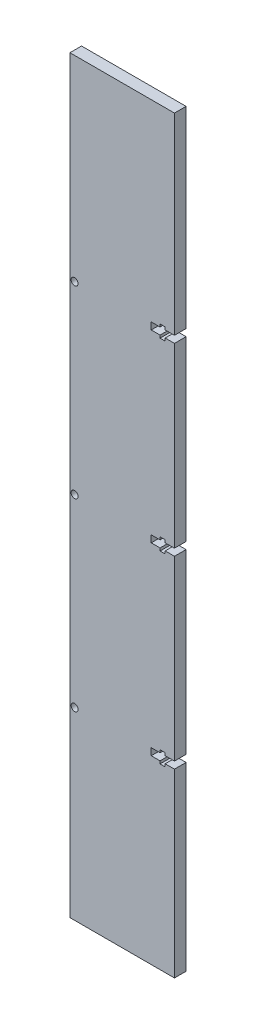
ISO-10303-21;
HEADER;
FILE_DESCRIPTION(('STEP AP214'),'2;1');
FILE_NAME('part.step','',(''),(''),'','','');
FILE_SCHEMA(('AUTOMOTIVE_DESIGN { 1 0 10303 214 1 1 1 1 }'));
ENDSEC;
DATA;
#1=APPLICATION_CONTEXT('core data for automotive mechanical design processes');
#2=APPLICATION_PROTOCOL_DEFINITION('international standard','automotive_design',2000,#1);
#3=PRODUCT_CONTEXT('',#1,'mechanical');
#4=PRODUCT('Part','Part','',(#3));
#5=PRODUCT_RELATED_PRODUCT_CATEGORY('part','',(#4));
#6=PRODUCT_DEFINITION_FORMATION('','',#4);
#7=PRODUCT_DEFINITION_CONTEXT('part definition',#1,'design');
#8=PRODUCT_DEFINITION('design','',#6,#7);
#9=PRODUCT_DEFINITION_SHAPE('','',#8);
#10=(LENGTH_UNIT() NAMED_UNIT(*) SI_UNIT(.MILLI.,.METRE.));
#11=(NAMED_UNIT(*) PLANE_ANGLE_UNIT() SI_UNIT($,.RADIAN.));
#12=(NAMED_UNIT(*) SI_UNIT($,.STERADIAN.) SOLID_ANGLE_UNIT());
#13=UNCERTAINTY_MEASURE_WITH_UNIT(LENGTH_MEASURE(1.E-05),#10,'distance_accuracy_value','');
#14=(GEOMETRIC_REPRESENTATION_CONTEXT(3) GLOBAL_UNCERTAINTY_ASSIGNED_CONTEXT((#13)) GLOBAL_UNIT_ASSIGNED_CONTEXT((#10,
#11,#12)) REPRESENTATION_CONTEXT('',''));
#15=CARTESIAN_POINT('',(0.,0.,0.));
#16=DIRECTION('',(0.,0.,1.));
#17=DIRECTION('',(1.,0.,0.));
#18=AXIS2_PLACEMENT_3D('',#15,#16,#17);
#19=CARTESIAN_POINT('',(18.4999999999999,6.13941264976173E-13,10.));
#20=DIRECTION('',(1.,0.,0.));
#21=DIRECTION('',(0.,1.,0.));
#22=AXIS2_PLACEMENT_3D('',#19,#20,#21);
#23=PLANE('',#22);
#24=DIRECTION('',(0.,0.,1.));
#25=VECTOR('',#24,1.);
#26=CARTESIAN_POINT('',(18.5,-3.99999999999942,10.));
#27=LINE('',#26,#25);
#28=CARTESIAN_POINT('',(18.5,-3.99999999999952,5.));
#29=VERTEX_POINT('',#28);
#30=CARTESIAN_POINT('',(18.5,-3.99999999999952,0.));
#31=VERTEX_POINT('',#30);
#32=EDGE_CURVE('E283',#29,#31,#27,.F.);
#33=ORIENTED_EDGE('',*,*,#32,.T.);
#34=DIRECTION('',(0.,1.,0.));
#35=VECTOR('',#34,1.);
#36=CARTESIAN_POINT('',(18.5,0.,0.));
#37=LINE('',#36,#35);
#38=CARTESIAN_POINT('',(18.5,-5.14999999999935,0.));
#39=VERTEX_POINT('',#38);
#40=EDGE_CURVE('E286',#31,#39,#37,.F.);
#41=ORIENTED_EDGE('',*,*,#40,.T.);
#42=DIRECTION('',(0.,0.,1.));
#43=VECTOR('',#42,1.);
#44=CARTESIAN_POINT('',(18.5000000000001,-5.14999999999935,10.));
#45=LINE('',#44,#43);
#46=CARTESIAN_POINT('',(18.5,-5.14999999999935,5.));
#47=VERTEX_POINT('',#46);
#48=EDGE_CURVE('E525',#39,#47,#45,.T.);
#49=ORIENTED_EDGE('',*,*,#48,.T.);
#50=DIRECTION('',(0.,1.,0.));
#51=VECTOR('',#50,1.);
#52=CARTESIAN_POINT('',(18.4999999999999,6.13941264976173E-13,5.));
#53=LINE('',#52,#51);
#54=EDGE_CURVE('E288',#29,#47,#53,.F.);
#55=ORIENTED_EDGE('',*,*,#54,.F.);
#56=EDGE_LOOP('',(#33,#41,#49,#55));
#57=FACE_BOUND('',#56,.T.);
#58=ADVANCED_FACE('F25',(#57),#23,.F.);
#59=CARTESIAN_POINT('',(16.2999999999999,5.40932033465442E-13,10.));
#60=DIRECTION('',(-1.,0.,0.));
#61=DIRECTION('',(0.,-1.,0.));
#62=AXIS2_PLACEMENT_3D('',#59,#60,#61);
#63=PLANE('',#62);
#64=DIRECTION('',(0.,0.,1.));
#65=VECTOR('',#64,1.);
#66=CARTESIAN_POINT('',(16.3000000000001,-5.14999999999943,10.));
#67=LINE('',#66,#65);
#68=CARTESIAN_POINT('',(16.3000000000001,-5.14999999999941,5.));
#69=VERTEX_POINT('',#68);
#70=CARTESIAN_POINT('',(16.3000000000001,-5.14999999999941,0.));
#71=VERTEX_POINT('',#70);
#72=EDGE_CURVE('E278',#69,#71,#67,.F.);
#73=ORIENTED_EDGE('',*,*,#72,.T.);
#74=DIRECTION('',(0.,1.,0.));
#75=VECTOR('',#74,1.);
#76=CARTESIAN_POINT('',(16.3000000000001,0.,0.));
#77=LINE('',#76,#75);
#78=CARTESIAN_POINT('',(16.3,-3.99999999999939,0.));
#79=VERTEX_POINT('',#78);
#80=EDGE_CURVE('E331',#71,#79,#77,.T.);
#81=ORIENTED_EDGE('',*,*,#80,.T.);
#82=DIRECTION('',(0.,0.,1.));
#83=VECTOR('',#82,1.);
#84=CARTESIAN_POINT('',(16.3,-3.99999999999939,10.));
#85=LINE('',#84,#83);
#86=CARTESIAN_POINT('',(16.3,-3.99999999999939,5.));
#87=VERTEX_POINT('',#86);
#88=EDGE_CURVE('E519',#79,#87,#85,.T.);
#89=ORIENTED_EDGE('',*,*,#88,.T.);
#90=DIRECTION('',(0.,-1.,0.));
#91=VECTOR('',#90,1.);
#92=CARTESIAN_POINT('',(16.2999999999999,5.40932033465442E-13,5.));
#93=LINE('',#92,#91);
#94=EDGE_CURVE('E353',#69,#87,#93,.F.);
#95=ORIENTED_EDGE('',*,*,#94,.F.);
#96=EDGE_LOOP('',(#73,#81,#89,#95));
#97=FACE_BOUND('',#96,.T.);
#98=ADVANCED_FACE('F1006',(#97),#63,.F.);
#99=CARTESIAN_POINT('',(16.2999999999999,4.42580754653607E-13,10.));
#100=DIRECTION('',(-1.,0.,0.));
#101=DIRECTION('',(0.,-1.,0.));
#102=AXIS2_PLACEMENT_3D('',#99,#100,#101);
#103=PLANE('',#102);
#104=DIRECTION('',(0.,0.,1.));
#105=VECTOR('',#104,1.);
#106=CARTESIAN_POINT('',(16.2999999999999,-0.999999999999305,10.));
#107=LINE('',#106,#105);
#108=CARTESIAN_POINT('',(16.2999999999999,-0.999999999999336,5.));
#109=VERTEX_POINT('',#108);
#110=CARTESIAN_POINT('',(16.2999999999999,-0.999999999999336,0.));
#111=VERTEX_POINT('',#110);
#112=EDGE_CURVE('E513',#109,#111,#107,.F.);
#113=ORIENTED_EDGE('',*,*,#112,.T.);
#114=DIRECTION('',(0.,1.,0.));
#115=VECTOR('',#114,1.);
#116=CARTESIAN_POINT('',(16.2999999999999,0.,0.));
#117=LINE('',#116,#115);
#118=CARTESIAN_POINT('',(16.2999999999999,0.150000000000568,0.));
#119=VERTEX_POINT('',#118);
#120=EDGE_CURVE('E329',#111,#119,#117,.T.);
#121=ORIENTED_EDGE('',*,*,#120,.T.);
#122=DIRECTION('',(0.,0.,1.));
#123=VECTOR('',#122,1.);
#124=CARTESIAN_POINT('',(16.2999999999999,0.150000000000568,10.));
#125=LINE('',#124,#123);
#126=CARTESIAN_POINT('',(16.2999999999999,0.150000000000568,5.));
#127=VERTEX_POINT('',#126);
#128=EDGE_CURVE('E501',#119,#127,#125,.T.);
#129=ORIENTED_EDGE('',*,*,#128,.T.);
#130=DIRECTION('',(0.,-1.,0.));
#131=VECTOR('',#130,1.);
#132=CARTESIAN_POINT('',(16.2999999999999,4.42580754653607E-13,5.));
#133=LINE('',#132,#131);
#134=EDGE_CURVE('E351',#109,#127,#133,.F.);
#135=ORIENTED_EDGE('',*,*,#134,.F.);
#136=EDGE_LOOP('',(#113,#121,#129,#135));
#137=FACE_BOUND('',#136,.T.);
#138=ADVANCED_FACE('F997',(#137),#103,.F.);
#139=CARTESIAN_POINT('',(18.4999999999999,6.13941264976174E-13,10.));
#140=DIRECTION('',(1.,0.,0.));
#141=DIRECTION('',(0.,1.,0.));
#142=AXIS2_PLACEMENT_3D('',#139,#140,#141);
#143=PLANE('',#142);
#144=DIRECTION('',(0.,0.,1.));
#145=VECTOR('',#144,1.);
#146=CARTESIAN_POINT('',(18.4999999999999,0.15000000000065,10.));
#147=LINE('',#146,#145);
#148=CARTESIAN_POINT('',(18.4999999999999,0.15000000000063,5.));
#149=VERTEX_POINT('',#148);
#150=CARTESIAN_POINT('',(18.4999999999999,0.15000000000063,0.));
#151=VERTEX_POINT('',#150);
#152=EDGE_CURVE('E507',#149,#151,#147,.F.);
#153=ORIENTED_EDGE('',*,*,#152,.T.);
#154=DIRECTION('',(0.,1.,0.));
#155=VECTOR('',#154,1.);
#156=CARTESIAN_POINT('',(18.4999999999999,0.,0.));
#157=LINE('',#156,#155);
#158=CARTESIAN_POINT('',(18.4999999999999,-0.999999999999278,0.));
#159=VERTEX_POINT('',#158);
#160=EDGE_CURVE('E327',#151,#159,#157,.F.);
#161=ORIENTED_EDGE('',*,*,#160,.T.);
#162=DIRECTION('',(0.,0.,1.));
#163=VECTOR('',#162,1.);
#164=CARTESIAN_POINT('',(18.4999999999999,-0.999999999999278,10.));
#165=LINE('',#164,#163);
#166=CARTESIAN_POINT('',(18.4999999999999,-0.999999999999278,5.));
#167=VERTEX_POINT('',#166);
#168=EDGE_CURVE('E495',#159,#167,#165,.T.);
#169=ORIENTED_EDGE('',*,*,#168,.T.);
#170=DIRECTION('',(0.,1.,0.));
#171=VECTOR('',#170,1.);
#172=CARTESIAN_POINT('',(18.4999999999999,6.13941264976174E-13,5.));
#173=LINE('',#172,#171);
#174=EDGE_CURVE('E349',#149,#167,#173,.F.);
#175=ORIENTED_EDGE('',*,*,#174,.F.);
#176=EDGE_LOOP('',(#153,#161,#169,#175));
#177=FACE_BOUND('',#176,.T.);
#178=ADVANCED_FACE('F988',(#177),#143,.F.);
#179=CARTESIAN_POINT('',(18.4999999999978,-5.02315580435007E-13,10.));
#180=DIRECTION('',(1.,0.,0.));
#181=DIRECTION('',(0.,1.,0.));
#182=AXIS2_PLACEMENT_3D('',#179,#180,#181);
#183=PLANE('',#182);
#184=DIRECTION('',(0.,0.,1.));
#185=VECTOR('',#184,1.);
#186=CARTESIAN_POINT('',(18.4999999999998,75.3750000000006,10.));
#187=LINE('',#186,#185);
#188=CARTESIAN_POINT('',(18.4999999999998,75.3750000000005,5.));
#189=VERTEX_POINT('',#188);
#190=CARTESIAN_POINT('',(18.4999999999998,75.3750000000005,0.));
#191=VERTEX_POINT('',#190);
#192=EDGE_CURVE('E489',#189,#191,#187,.F.);
#193=ORIENTED_EDGE('',*,*,#192,.T.);
#194=DIRECTION('',(0.,1.,0.));
#195=VECTOR('',#194,1.);
#196=CARTESIAN_POINT('',(18.4999999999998,0.,0.));
#197=LINE('',#196,#195);
#198=CARTESIAN_POINT('',(18.4999999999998,74.2250000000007,0.));
#199=VERTEX_POINT('',#198);
#200=EDGE_CURVE('E325',#191,#199,#197,.F.);
#201=ORIENTED_EDGE('',*,*,#200,.T.);
#202=DIRECTION('',(0.,0.,1.));
#203=VECTOR('',#202,1.);
#204=CARTESIAN_POINT('',(18.4999999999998,74.2250000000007,10.));
#205=LINE('',#204,#203);
#206=CARTESIAN_POINT('',(18.4999999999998,74.2250000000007,5.));
#207=VERTEX_POINT('',#206);
#208=EDGE_CURVE('E477',#199,#207,#205,.T.);
#209=ORIENTED_EDGE('',*,*,#208,.T.);
#210=DIRECTION('',(0.,1.,0.));
#211=VECTOR('',#210,1.);
#212=CARTESIAN_POINT('',(18.4999999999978,-5.02315580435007E-13,5.));
#213=LINE('',#212,#211);
#214=EDGE_CURVE('E347',#189,#207,#213,.F.);
#215=ORIENTED_EDGE('',*,*,#214,.F.);
#216=EDGE_LOOP('',(#193,#201,#209,#215));
#217=FACE_BOUND('',#216,.T.);
#218=ADVANCED_FACE('F979',(#217),#183,.F.);
#219=CARTESIAN_POINT('',(16.299999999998,-3.93405115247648E-13,10.));
#220=DIRECTION('',(-1.,0.,0.));
#221=DIRECTION('',(0.,-1.,0.));
#222=AXIS2_PLACEMENT_3D('',#219,#220,#221);
#223=PLANE('',#222);
#224=DIRECTION('',(0.,0.,1.));
#225=VECTOR('',#224,1.);
#226=CARTESIAN_POINT('',(16.2999999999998,74.2250000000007,10.));
#227=LINE('',#226,#225);
#228=CARTESIAN_POINT('',(16.2999999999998,74.2250000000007,5.));
#229=VERTEX_POINT('',#228);
#230=CARTESIAN_POINT('',(16.2999999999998,74.2250000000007,0.));
#231=VERTEX_POINT('',#230);
#232=EDGE_CURVE('E483',#229,#231,#227,.F.);
#233=ORIENTED_EDGE('',*,*,#232,.T.);
#234=DIRECTION('',(0.,1.,0.));
#235=VECTOR('',#234,1.);
#236=CARTESIAN_POINT('',(16.2999999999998,0.,0.));
#237=LINE('',#236,#235);
#238=CARTESIAN_POINT('',(16.2999999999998,75.3750000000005,0.));
#239=VERTEX_POINT('',#238);
#240=EDGE_CURVE('E323',#231,#239,#237,.T.);
#241=ORIENTED_EDGE('',*,*,#240,.T.);
#242=DIRECTION('',(0.,0.,1.));
#243=VECTOR('',#242,1.);
#244=CARTESIAN_POINT('',(16.2999999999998,75.3750000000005,10.));
#245=LINE('',#244,#243);
#246=CARTESIAN_POINT('',(16.2999999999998,75.3750000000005,5.));
#247=VERTEX_POINT('',#246);
#248=EDGE_CURVE('E471',#239,#247,#245,.T.);
#249=ORIENTED_EDGE('',*,*,#248,.T.);
#250=DIRECTION('',(0.,-1.,0.));
#251=VECTOR('',#250,1.);
#252=CARTESIAN_POINT('',(16.299999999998,-3.93405115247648E-13,5.));
#253=LINE('',#252,#251);
#254=EDGE_CURVE('E345',#229,#247,#253,.F.);
#255=ORIENTED_EDGE('',*,*,#254,.F.);
#256=EDGE_LOOP('',(#233,#241,#249,#255));
#257=FACE_BOUND('',#256,.T.);
#258=ADVANCED_FACE('F970',(#257),#223,.F.);
#259=CARTESIAN_POINT('',(16.299999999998,-3.9340511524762E-13,10.));
#260=DIRECTION('',(-1.,0.,0.));
#261=DIRECTION('',(0.,-1.,0.));
#262=AXIS2_PLACEMENT_3D('',#259,#260,#261);
#263=PLANE('',#262);
#264=DIRECTION('',(0.,0.,1.));
#265=VECTOR('',#264,1.);
#266=CARTESIAN_POINT('',(16.2999999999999,78.3750000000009,10.));
#267=LINE('',#266,#265);
#268=CARTESIAN_POINT('',(16.2999999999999,78.3750000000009,5.));
#269=VERTEX_POINT('',#268);
#270=CARTESIAN_POINT('',(16.2999999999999,78.3750000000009,0.));
#271=VERTEX_POINT('',#270);
#272=EDGE_CURVE('E465',#269,#271,#267,.F.);
#273=ORIENTED_EDGE('',*,*,#272,.T.);
#274=DIRECTION('',(0.,1.,0.));
#275=VECTOR('',#274,1.);
#276=CARTESIAN_POINT('',(16.2999999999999,0.,0.));
#277=LINE('',#276,#275);
#278=CARTESIAN_POINT('',(16.2999999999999,79.5250000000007,0.));
#279=VERTEX_POINT('',#278);
#280=EDGE_CURVE('E321',#271,#279,#277,.T.);
#281=ORIENTED_EDGE('',*,*,#280,.T.);
#282=DIRECTION('',(0.,0.,1.));
#283=VECTOR('',#282,1.);
#284=CARTESIAN_POINT('',(16.2999999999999,79.5250000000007,10.));
#285=LINE('',#284,#283);
#286=CARTESIAN_POINT('',(16.2999999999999,79.5250000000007,5.));
#287=VERTEX_POINT('',#286);
#288=EDGE_CURVE('E453',#279,#287,#285,.T.);
#289=ORIENTED_EDGE('',*,*,#288,.T.);
#290=DIRECTION('',(0.,-1.,0.));
#291=VECTOR('',#290,1.);
#292=CARTESIAN_POINT('',(16.299999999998,-3.9340511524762E-13,5.));
#293=LINE('',#292,#291);
#294=EDGE_CURVE('E343',#269,#287,#293,.F.);
#295=ORIENTED_EDGE('',*,*,#294,.F.);
#296=EDGE_LOOP('',(#273,#281,#289,#295));
#297=FACE_BOUND('',#296,.T.);
#298=ADVANCED_FACE('F961',(#297),#263,.F.);
#299=CARTESIAN_POINT('',(18.4999999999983,-3.9068989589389E-13,10.));
#300=DIRECTION('',(1.,0.,0.));
#301=DIRECTION('',(0.,1.,0.));
#302=AXIS2_PLACEMENT_3D('',#299,#300,#301);
#303=PLANE('',#302);
#304=DIRECTION('',(0.,0.,1.));
#305=VECTOR('',#304,1.);
#306=CARTESIAN_POINT('',(18.4999999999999,79.5250000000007,10.));
#307=LINE('',#306,#305);
#308=CARTESIAN_POINT('',(18.4999999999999,79.5250000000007,5.));
#309=VERTEX_POINT('',#308);
#310=CARTESIAN_POINT('',(18.4999999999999,79.5250000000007,0.));
#311=VERTEX_POINT('',#310);
#312=EDGE_CURVE('E459',#309,#311,#307,.F.);
#313=ORIENTED_EDGE('',*,*,#312,.T.);
#314=DIRECTION('',(0.,1.,0.));
#315=VECTOR('',#314,1.);
#316=CARTESIAN_POINT('',(18.4999999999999,0.,0.));
#317=LINE('',#316,#315);
#318=CARTESIAN_POINT('',(18.4999999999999,78.3750000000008,0.));
#319=VERTEX_POINT('',#318);
#320=EDGE_CURVE('E319',#311,#319,#317,.F.);
#321=ORIENTED_EDGE('',*,*,#320,.T.);
#322=DIRECTION('',(0.,0.,1.));
#323=VECTOR('',#322,1.);
#324=CARTESIAN_POINT('',(18.4999999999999,78.3750000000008,10.));
#325=LINE('',#324,#323);
#326=CARTESIAN_POINT('',(18.4999999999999,78.3750000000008,5.));
#327=VERTEX_POINT('',#326);
#328=EDGE_CURVE('E447',#319,#327,#325,.T.);
#329=ORIENTED_EDGE('',*,*,#328,.T.);
#330=DIRECTION('',(0.,1.,0.));
#331=VECTOR('',#330,1.);
#332=CARTESIAN_POINT('',(18.4999999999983,-3.9068989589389E-13,5.));
#333=LINE('',#332,#331);
#334=EDGE_CURVE('E341',#309,#327,#333,.F.);
#335=ORIENTED_EDGE('',*,*,#334,.F.);
#336=EDGE_LOOP('',(#313,#321,#329,#335));
#337=FACE_BOUND('',#336,.T.);
#338=ADVANCED_FACE('F952',(#337),#303,.F.);
#339=CARTESIAN_POINT('',(18.4999999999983,4.46502738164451E-13,10.));
#340=DIRECTION('',(1.,0.,0.));
#341=DIRECTION('',(0.,1.,0.));
#342=AXIS2_PLACEMENT_3D('',#339,#340,#341);
#343=PLANE('',#342);
#344=DIRECTION('',(0.,0.,1.));
#345=VECTOR('',#344,1.);
#346=CARTESIAN_POINT('',(18.5000000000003,-83.3749999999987,10.));
#347=LINE('',#346,#345);
#348=CARTESIAN_POINT('',(18.5000000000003,-83.3749999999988,5.));
#349=VERTEX_POINT('',#348);
#350=CARTESIAN_POINT('',(18.5000000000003,-83.3749999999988,0.));
#351=VERTEX_POINT('',#350);
#352=EDGE_CURVE('E421',#349,#351,#347,.F.);
#353=ORIENTED_EDGE('',*,*,#352,.T.);
#354=DIRECTION('',(0.,1.,0.));
#355=VECTOR('',#354,1.);
#356=CARTESIAN_POINT('',(18.5000000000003,0.,0.));
#357=LINE('',#356,#355);
#358=CARTESIAN_POINT('',(18.5000000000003,-84.5249999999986,0.));
#359=VERTEX_POINT('',#358);
#360=EDGE_CURVE('E317',#351,#359,#357,.F.);
#361=ORIENTED_EDGE('',*,*,#360,.T.);
#362=DIRECTION('',(0.,0.,1.));
#363=VECTOR('',#362,1.);
#364=CARTESIAN_POINT('',(18.5000000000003,-84.5249999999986,10.));
#365=LINE('',#364,#363);
#366=CARTESIAN_POINT('',(18.5000000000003,-84.5249999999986,5.));
#367=VERTEX_POINT('',#366);
#368=EDGE_CURVE('E409',#359,#367,#365,.T.);
#369=ORIENTED_EDGE('',*,*,#368,.T.);
#370=DIRECTION('',(0.,1.,0.));
#371=VECTOR('',#370,1.);
#372=CARTESIAN_POINT('',(18.4999999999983,4.46502738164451E-13,5.));
#373=LINE('',#372,#371);
#374=EDGE_CURVE('E339',#349,#367,#373,.F.);
#375=ORIENTED_EDGE('',*,*,#374,.F.);
#376=EDGE_LOOP('',(#353,#361,#369,#375));
#377=FACE_BOUND('',#376,.T.);
#378=ADVANCED_FACE('F943',(#377),#343,.F.);
#379=CARTESIAN_POINT('',(16.3000000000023,-3.93405115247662E-13,10.));
#380=DIRECTION('',(-1.,0.,0.));
#381=DIRECTION('',(0.,-1.,0.));
#382=AXIS2_PLACEMENT_3D('',#379,#380,#381);
#383=PLANE('',#382);
#384=DIRECTION('',(0.,0.,1.));
#385=VECTOR('',#384,1.);
#386=CARTESIAN_POINT('',(16.3000000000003,-84.5249999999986,10.));
#387=LINE('',#386,#385);
#388=CARTESIAN_POINT('',(16.3000000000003,-84.5249999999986,5.));
#389=VERTEX_POINT('',#388);
#390=CARTESIAN_POINT('',(16.3000000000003,-84.5249999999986,0.));
#391=VERTEX_POINT('',#390);
#392=EDGE_CURVE('E415',#389,#391,#387,.F.);
#393=ORIENTED_EDGE('',*,*,#392,.T.);
#394=DIRECTION('',(0.,1.,0.));
#395=VECTOR('',#394,1.);
#396=CARTESIAN_POINT('',(16.3000000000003,0.,0.));
#397=LINE('',#396,#395);
#398=CARTESIAN_POINT('',(16.3000000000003,-83.3749999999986,0.));
#399=VERTEX_POINT('',#398);
#400=EDGE_CURVE('E315',#391,#399,#397,.T.);
#401=ORIENTED_EDGE('',*,*,#400,.T.);
#402=DIRECTION('',(0.,0.,1.));
#403=VECTOR('',#402,1.);
#404=CARTESIAN_POINT('',(16.3000000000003,-83.3749999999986,10.));
#405=LINE('',#404,#403);
#406=CARTESIAN_POINT('',(16.3000000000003,-83.3749999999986,5.));
#407=VERTEX_POINT('',#406);
#408=EDGE_CURVE('E403',#399,#407,#405,.T.);
#409=ORIENTED_EDGE('',*,*,#408,.T.);
#410=DIRECTION('',(0.,-1.,0.));
#411=VECTOR('',#410,1.);
#412=CARTESIAN_POINT('',(16.3000000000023,-3.93405115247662E-13,5.));
#413=LINE('',#412,#411);
#414=EDGE_CURVE('E337',#389,#407,#413,.F.);
#415=ORIENTED_EDGE('',*,*,#414,.F.);
#416=EDGE_LOOP('',(#393,#401,#409,#415));
#417=FACE_BOUND('',#416,.T.);
#418=ADVANCED_FACE('F934',(#417),#383,.F.);
#419=CARTESIAN_POINT('',(16.3000000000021,-3.44229475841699E-13,10.));
#420=DIRECTION('',(-1.,0.,0.));
#421=DIRECTION('',(0.,-1.,0.));
#422=AXIS2_PLACEMENT_3D('',#419,#420,#421);
#423=PLANE('',#422);
#424=DIRECTION('',(0.,0.,1.));
#425=VECTOR('',#424,1.);
#426=CARTESIAN_POINT('',(16.3000000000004,-80.3749999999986,10.));
#427=LINE('',#426,#425);
#428=CARTESIAN_POINT('',(16.3000000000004,-80.3749999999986,5.));
#429=VERTEX_POINT('',#428);
#430=CARTESIAN_POINT('',(16.3000000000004,-80.3749999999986,0.));
#431=VERTEX_POINT('',#430);
#432=EDGE_CURVE('E397',#429,#431,#427,.F.);
#433=ORIENTED_EDGE('',*,*,#432,.T.);
#434=DIRECTION('',(0.,1.,0.));
#435=VECTOR('',#434,1.);
#436=CARTESIAN_POINT('',(16.3000000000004,0.,0.));
#437=LINE('',#436,#435);
#438=CARTESIAN_POINT('',(16.3000000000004,-79.2249999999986,0.));
#439=VERTEX_POINT('',#438);
#440=EDGE_CURVE('E313',#431,#439,#437,.T.);
#441=ORIENTED_EDGE('',*,*,#440,.T.);
#442=DIRECTION('',(0.,0.,1.));
#443=VECTOR('',#442,1.);
#444=CARTESIAN_POINT('',(16.3000000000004,-79.2249999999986,10.));
#445=LINE('',#444,#443);
#446=CARTESIAN_POINT('',(16.3000000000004,-79.2249999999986,5.));
#447=VERTEX_POINT('',#446);
#448=EDGE_CURVE('E385',#439,#447,#445,.T.);
#449=ORIENTED_EDGE('',*,*,#448,.T.);
#450=DIRECTION('',(0.,-1.,0.));
#451=VECTOR('',#450,1.);
#452=CARTESIAN_POINT('',(16.3000000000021,-3.44229475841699E-13,5.));
#453=LINE('',#452,#451);
#454=EDGE_CURVE('E335',#429,#447,#453,.F.);
#455=ORIENTED_EDGE('',*,*,#454,.F.);
#456=EDGE_LOOP('',(#433,#441,#449,#455));
#457=FACE_BOUND('',#456,.T.);
#458=ADVANCED_FACE('F925',(#457),#423,.F.);
#459=CARTESIAN_POINT('',(18.5000000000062,-1.33950821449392E-12,10.));
#460=DIRECTION('',(1.,0.,0.));
#461=DIRECTION('',(0.,1.,0.));
#462=AXIS2_PLACEMENT_3D('',#459,#460,#461);
#463=PLANE('',#462);
#464=DIRECTION('',(0.,0.,1.));
#465=VECTOR('',#464,1.);
#466=CARTESIAN_POINT('',(18.5000000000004,-79.2249999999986,10.));
#467=LINE('',#466,#465);
#468=CARTESIAN_POINT('',(18.5000000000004,-79.2249999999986,5.));
#469=VERTEX_POINT('',#468);
#470=CARTESIAN_POINT('',(18.5000000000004,-79.2249999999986,0.));
#471=VERTEX_POINT('',#470);
#472=EDGE_CURVE('E391',#469,#471,#467,.F.);
#473=ORIENTED_EDGE('',*,*,#472,.T.);
#474=DIRECTION('',(0.,1.,0.));
#475=VECTOR('',#474,1.);
#476=CARTESIAN_POINT('',(18.5000000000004,0.,0.));
#477=LINE('',#476,#475);
#478=CARTESIAN_POINT('',(18.5000000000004,-80.3749999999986,0.));
#479=VERTEX_POINT('',#478);
#480=EDGE_CURVE('E302',#471,#479,#477,.F.);
#481=ORIENTED_EDGE('',*,*,#480,.T.);
#482=DIRECTION('',(0.,0.,1.));
#483=VECTOR('',#482,1.);
#484=CARTESIAN_POINT('',(18.5000000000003,-80.3749999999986,10.));
#485=LINE('',#484,#483);
#486=CARTESIAN_POINT('',(18.5000000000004,-80.3749999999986,5.));
#487=VERTEX_POINT('',#486);
#488=EDGE_CURVE('E380',#479,#487,#485,.T.);
#489=ORIENTED_EDGE('',*,*,#488,.T.);
#490=DIRECTION('',(0.,1.,0.));
#491=VECTOR('',#490,1.);
#492=CARTESIAN_POINT('',(18.5000000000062,-1.33950821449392E-12,5.));
#493=LINE('',#492,#491);
#494=EDGE_CURVE('E333',#469,#487,#493,.F.);
#495=ORIENTED_EDGE('',*,*,#494,.F.);
#496=EDGE_LOOP('',(#473,#481,#489,#495));
#497=FACE_BOUND('',#496,.T.);
#498=ADVANCED_FACE('F917',(#497),#463,.F.);
#499=CARTESIAN_POINT('',(0.,0.,0.));
#500=DIRECTION('',(0.,0.,1.));
#501=DIRECTION('',(1.,0.,0.));
#502=AXIS2_PLACEMENT_3D('',#499,#500,#501);
#503=PLANE('',#502);
#504=DIRECTION('',(1.,-2.05131051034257E-13,0.));
#505=VECTOR('',#504,1.);
#506=CARTESIAN_POINT('',(-8.20524204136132E-13,-3.99999999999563,0.));
#507=LINE('',#506,#505);
#508=CARTESIAN_POINT('',(22.5,-4.00000000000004,0.));
#509=VERTEX_POINT('',#508);
#510=EDGE_CURVE('E292',#31,#509,#507,.T.);
#511=ORIENTED_EDGE('',*,*,#510,.T.);
#512=DIRECTION('',(0.,-1.,0.));
#513=VECTOR('',#512,1.);
#514=CARTESIAN_POINT('',(22.5,161.25,0.));
#515=LINE('',#514,#513);
#516=CARTESIAN_POINT('',(22.5,-80.3749999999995,0.));
#517=VERTEX_POINT('',#516);
#518=EDGE_CURVE('E370',#509,#517,#515,.T.);
#519=ORIENTED_EDGE('',*,*,#518,.T.);
#520=DIRECTION('',(-1.,3.81639164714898E-13,0.));
#521=VECTOR('',#520,1.);
#522=CARTESIAN_POINT('',(-3.06742478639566E-11,-80.3749999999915,0.));
#523=LINE('',#522,#521);
#524=EDGE_CURVE('E383',#517,#479,#523,.T.);
#525=ORIENTED_EDGE('',*,*,#524,.T.);
#526=ORIENTED_EDGE('',*,*,#480,.F.);
#527=DIRECTION('',(-1.,0.,0.));
#528=VECTOR('',#527,1.);
#529=CARTESIAN_POINT('',(-1.49927418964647E-12,-79.2249999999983,0.));
#530=LINE('',#529,#528);
#531=EDGE_CURVE('E388',#471,#439,#530,.T.);
#532=ORIENTED_EDGE('',*,*,#531,.T.);
#533=ORIENTED_EDGE('',*,*,#440,.F.);
#534=DIRECTION('',(-1.,0.,0.));
#535=VECTOR('',#534,1.);
#536=CARTESIAN_POINT('',(-1.76120083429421E-12,-80.3749999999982,0.));
#537=LINE('',#536,#535);
#538=CARTESIAN_POINT('',(12.5000000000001,-80.3749999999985,0.));
#539=VERTEX_POINT('',#538);
#540=EDGE_CURVE('E395',#431,#539,#537,.T.);
#541=ORIENTED_EDGE('',*,*,#540,.T.);
#542=DIRECTION('',(0.,-1.,0.));
#543=VECTOR('',#542,1.);
#544=CARTESIAN_POINT('',(12.500000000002,-2.89120579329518E-13,0.));
#545=LINE('',#544,#543);
#546=CARTESIAN_POINT('',(12.5000000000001,-83.3749999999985,0.));
#547=VERTEX_POINT('',#546);
#548=EDGE_CURVE('E401',#539,#547,#545,.T.);
#549=ORIENTED_EDGE('',*,*,#548,.T.);
#550=DIRECTION('',(1.,0.,0.));
#551=VECTOR('',#550,1.);
#552=CARTESIAN_POINT('',(-1.82693772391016E-12,-83.3749999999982,0.));
#553=LINE('',#552,#551);
#554=EDGE_CURVE('E406',#547,#399,#553,.T.);
#555=ORIENTED_EDGE('',*,*,#554,.T.);
#556=ORIENTED_EDGE('',*,*,#400,.F.);
#557=DIRECTION('',(1.,0.,0.));
#558=VECTOR('',#557,1.);
#559=CARTESIAN_POINT('',(-1.59957274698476E-12,-84.5249999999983,0.));
#560=LINE('',#559,#558);
#561=EDGE_CURVE('E412',#391,#359,#560,.T.);
#562=ORIENTED_EDGE('',*,*,#561,.T.);
#563=ORIENTED_EDGE('',*,*,#360,.F.);
#564=DIRECTION('',(1.,-3.40005801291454E-13,0.));
#565=VECTOR('',#564,1.);
#566=CARTESIAN_POINT('',(-2.83479836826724E-11,-83.3749999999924,0.));
#567=LINE('',#566,#565);
#568=CARTESIAN_POINT('',(22.5,-83.3749999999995,0.));
#569=VERTEX_POINT('',#568);
#570=EDGE_CURVE('E419',#351,#569,#567,.T.);
#571=ORIENTED_EDGE('',*,*,#570,.T.);
#572=DIRECTION('',(0.,-1.,0.));
#573=VECTOR('',#572,1.);
#574=CARTESIAN_POINT('',(22.5,161.25,0.));
#575=LINE('',#574,#573);
#576=CARTESIAN_POINT('',(22.5,-161.25,0.));
#577=VERTEX_POINT('',#576);
#578=EDGE_CURVE('E423',#569,#577,#575,.T.);
#579=ORIENTED_EDGE('',*,*,#578,.T.);
#580=DIRECTION('',(1.,0.,0.));
#581=VECTOR('',#580,1.);
#582=CARTESIAN_POINT('',(-22.5,-161.25,0.));
#583=LINE('',#582,#581);
#584=CARTESIAN_POINT('',(-22.5,-161.25,0.));
#585=VERTEX_POINT('',#584);
#586=EDGE_CURVE('E428',#577,#585,#583,.F.);
#587=ORIENTED_EDGE('',*,*,#586,.T.);
#588=DIRECTION('',(0.,1.,0.));
#589=VECTOR('',#588,1.);
#590=CARTESIAN_POINT('',(-22.5,161.25,0.));
#591=LINE('',#590,#589);
#592=CARTESIAN_POINT('',(-22.5,161.25,0.));
#593=VERTEX_POINT('',#592);
#594=EDGE_CURVE('E433',#585,#593,#591,.T.);
#595=ORIENTED_EDGE('',*,*,#594,.T.);
#596=DIRECTION('',(1.,0.,0.));
#597=VECTOR('',#596,1.);
#598=CARTESIAN_POINT('',(-22.5,161.25,0.));
#599=LINE('',#598,#597);
#600=CARTESIAN_POINT('',(22.5,161.25,0.));
#601=VERTEX_POINT('',#600);
#602=EDGE_CURVE('E438',#593,#601,#599,.T.);
#603=ORIENTED_EDGE('',*,*,#602,.T.);
#604=DIRECTION('',(0.,-1.,0.));
#605=VECTOR('',#604,1.);
#606=CARTESIAN_POINT('',(22.5,161.25,0.));
#607=LINE('',#606,#605);
#608=CARTESIAN_POINT('',(22.5,78.3750000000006,0.));
#609=VERTEX_POINT('',#608);
#610=EDGE_CURVE('E445',#601,#609,#607,.T.);
#611=ORIENTED_EDGE('',*,*,#610,.T.);
#612=DIRECTION('',(-1.,1.45716771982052E-13,0.));
#613=VECTOR('',#612,1.);
#614=CARTESIAN_POINT('',(1.14205520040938E-11,78.3750000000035,0.));
#615=LINE('',#614,#613);
#616=EDGE_CURVE('E450',#609,#319,#615,.T.);
#617=ORIENTED_EDGE('',*,*,#616,.T.);
#618=ORIENTED_EDGE('',*,*,#320,.F.);
#619=DIRECTION('',(-1.,0.,0.));
#620=VECTOR('',#619,1.);
#621=CARTESIAN_POINT('',(1.00330097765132E-12,79.5250000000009,0.));
#622=LINE('',#621,#620);
#623=EDGE_CURVE('E456',#311,#279,#622,.T.);
#624=ORIENTED_EDGE('',*,*,#623,.T.);
#625=ORIENTED_EDGE('',*,*,#280,.F.);
#626=DIRECTION('',(-1.,0.,0.));
#627=VECTOR('',#626,1.);
#628=CARTESIAN_POINT('',(2.00360561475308E-12,78.3750000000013,0.));
#629=LINE('',#628,#627);
#630=CARTESIAN_POINT('',(12.4999999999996,78.375000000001,0.));
#631=VERTEX_POINT('',#630);
#632=EDGE_CURVE('E463',#271,#631,#629,.T.);
#633=ORIENTED_EDGE('',*,*,#632,.T.);
#634=DIRECTION('',(0.,-1.,0.));
#635=VECTOR('',#634,1.);
#636=CARTESIAN_POINT('',(12.4999999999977,-3.10804622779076E-13,0.));
#637=LINE('',#636,#635);
#638=CARTESIAN_POINT('',(12.4999999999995,75.3750000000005,0.));
#639=VERTEX_POINT('',#638);
#640=EDGE_CURVE('E469',#631,#639,#637,.T.);
#641=ORIENTED_EDGE('',*,*,#640,.T.);
#642=DIRECTION('',(1.,0.,0.));
#643=VECTOR('',#642,1.);
#644=CARTESIAN_POINT('',(1.92691257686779E-12,75.3750000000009,0.));
#645=LINE('',#644,#643);
#646=EDGE_CURVE('E474',#639,#239,#645,.T.);
#647=ORIENTED_EDGE('',*,*,#646,.T.);
#648=ORIENTED_EDGE('',*,*,#240,.F.);
#649=DIRECTION('',(1.,0.,0.));
#650=VECTOR('',#649,1.);
#651=CARTESIAN_POINT('',(9.36435272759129E-13,74.2250000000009,0.));
#652=LINE('',#651,#650);
#653=EDGE_CURVE('E480',#231,#199,#652,.T.);
#654=ORIENTED_EDGE('',*,*,#653,.T.);
#655=ORIENTED_EDGE('',*,*,#200,.F.);
#656=DIRECTION('',(1.,-2.1163626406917E-13,0.));
#657=VECTOR('',#656,1.);
#658=CARTESIAN_POINT('',(1.59520834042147E-11,75.3750000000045,0.));
#659=LINE('',#658,#657);
#660=CARTESIAN_POINT('',(22.5,75.3750000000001,0.));
#661=VERTEX_POINT('',#660);
#662=EDGE_CURVE('E487',#191,#661,#659,.T.);
#663=ORIENTED_EDGE('',*,*,#662,.T.);
#664=DIRECTION('',(0.,-1.,0.));
#665=VECTOR('',#664,1.);
#666=CARTESIAN_POINT('',(22.5,161.25,0.));
#667=LINE('',#666,#665);
#668=CARTESIAN_POINT('',(22.5,-0.999999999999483,0.));
#669=VERTEX_POINT('',#668);
#670=EDGE_CURVE('E493',#661,#669,#667,.T.);
#671=ORIENTED_EDGE('',*,*,#670,.T.);
#672=DIRECTION('',(-1.,1.35525271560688E-13,0.));
#673=VECTOR('',#672,1.);
#674=CARTESIAN_POINT('',(-1.3552527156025E-13,-0.999999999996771,0.));
#675=LINE('',#674,#673);
#676=EDGE_CURVE('E498',#669,#159,#675,.T.);
#677=ORIENTED_EDGE('',*,*,#676,.T.);
#678=ORIENTED_EDGE('',*,*,#160,.F.);
#679=DIRECTION('',(-1.,0.,0.));
#680=VECTOR('',#679,1.);
#681=CARTESIAN_POINT('',(0.,0.149999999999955,0.));
#682=LINE('',#681,#680);
#683=EDGE_CURVE('E504',#151,#119,#682,.T.);
#684=ORIENTED_EDGE('',*,*,#683,.T.);
#685=ORIENTED_EDGE('',*,*,#120,.F.);
#686=DIRECTION('',(-1.,0.,0.));
#687=VECTOR('',#686,1.);
#688=CARTESIAN_POINT('',(0.,-0.999999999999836,0.));
#689=LINE('',#688,#687);
#690=CARTESIAN_POINT('',(12.4999999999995,-0.999999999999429,0.));
#691=VERTEX_POINT('',#690);
#692=EDGE_CURVE('E511',#111,#691,#689,.T.);
#693=ORIENTED_EDGE('',*,*,#692,.T.);
#694=DIRECTION('',(0.,-1.,0.));
#695=VECTOR('',#694,1.);
#696=CARTESIAN_POINT('',(12.4999999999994,4.04768811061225E-13,0.));
#697=LINE('',#696,#695);
#698=CARTESIAN_POINT('',(12.4999999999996,-3.99999999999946,0.));
#699=VERTEX_POINT('',#698);
#700=EDGE_CURVE('E517',#691,#699,#697,.T.);
#701=ORIENTED_EDGE('',*,*,#700,.T.);
#702=DIRECTION('',(1.,0.,0.));
#703=VECTOR('',#702,1.);
#704=CARTESIAN_POINT('',(1.30560766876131E-13,-3.99999999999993,0.));
#705=LINE('',#704,#703);
#706=EDGE_CURVE('E522',#699,#79,#705,.T.);
#707=ORIENTED_EDGE('',*,*,#706,.T.);
#708=ORIENTED_EDGE('',*,*,#80,.F.);
#709=DIRECTION('',(1.,0.,0.));
#710=VECTOR('',#709,1.);
#711=CARTESIAN_POINT('',(1.92889422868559E-13,-5.15000000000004,0.));
#712=LINE('',#711,#710);
#713=EDGE_CURVE('E300',#71,#39,#712,.T.);
#714=ORIENTED_EDGE('',*,*,#713,.T.);
#715=ORIENTED_EDGE('',*,*,#40,.F.);
#716=EDGE_LOOP('',(#511,#519,#525,#526,#532,#533,#541,#549,#555,#556,#562,#563,#571,#579,#587,
#595,#603,#611,#617,#618,#624,#625,#633,#641,#647,#648,#654,#655,#663,#671,#677,#678,#684,#685,
#693,#701,#707,#708,#714,#715));
#717=FACE_BOUND('',#716,.T.);
#718=CARTESIAN_POINT('',(-20.5,-2.49000000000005,0.));
#719=DIRECTION('',(0.,0.,-1.));
#720=DIRECTION('',(-1.,0.,0.));
#721=AXIS2_PLACEMENT_3D('',#718,#719,#720);
#722=CIRCLE('',#721,1.5);
#723=CARTESIAN_POINT('',(-22.,-2.49000000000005,0.));
#724=VERTEX_POINT('',#723);
#725=EDGE_CURVE('E362',#724,#724,#722,.F.);
#726=ORIENTED_EDGE('',*,*,#725,.T.);
#727=EDGE_LOOP('',(#726));
#728=FACE_BOUND('',#727,.T.);
#729=CARTESIAN_POINT('',(-20.5,-81.87,0.));
#730=DIRECTION('',(0.,0.,-1.));
#731=DIRECTION('',(-1.,0.,0.));
#732=AXIS2_PLACEMENT_3D('',#729,#730,#731);
#733=CIRCLE('',#732,1.50000000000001);
#734=CARTESIAN_POINT('',(-22.,-81.87,0.));
#735=VERTEX_POINT('',#734);
#736=EDGE_CURVE('E365',#735,#735,#733,.F.);
#737=ORIENTED_EDGE('',*,*,#736,.T.);
#738=EDGE_LOOP('',(#737));
#739=FACE_BOUND('',#738,.T.);
#740=CARTESIAN_POINT('',(-20.5,76.8899999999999,0.));
#741=DIRECTION('',(0.,0.,-1.));
#742=DIRECTION('',(-1.,0.,0.));
#743=AXIS2_PLACEMENT_3D('',#740,#741,#742);
#744=CIRCLE('',#743,1.5);
#745=CARTESIAN_POINT('',(-22.,76.8899999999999,0.));
#746=VERTEX_POINT('',#745);
#747=EDGE_CURVE('E28',#746,#746,#744,.F.);
#748=ORIENTED_EDGE('',*,*,#747,.T.);
#749=EDGE_LOOP('',(#748));
#750=FACE_BOUND('',#749,.T.);
#751=ADVANCED_FACE('F295',(#717,#728,#739,#750),#503,.F.);
#752=CARTESIAN_POINT('',(-8.20524204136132E-13,-3.99999999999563,10.));
#753=DIRECTION('',(-2.05131051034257E-13,-1.,0.));
#754=DIRECTION('',(1.,-2.05131051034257E-13,0.));
#755=AXIS2_PLACEMENT_3D('',#752,#753,#754);
#756=PLANE('',#755);
#757=DIRECTION('',(0.,0.,1.));
#758=VECTOR('',#757,1.);
#759=CARTESIAN_POINT('',(22.5,-3.99999999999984,5.));
#760=LINE('',#759,#758);
#761=CARTESIAN_POINT('',(22.5,-4.00000000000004,5.));
#762=VERTEX_POINT('',#761);
#763=EDGE_CURVE('E306',#762,#509,#760,.F.);
#764=ORIENTED_EDGE('',*,*,#763,.T.);
#765=ORIENTED_EDGE('',*,*,#510,.F.);
#766=ORIENTED_EDGE('',*,*,#32,.F.);
#767=DIRECTION('',(1.,0.,0.));
#768=VECTOR('',#767,1.);
#769=CARTESIAN_POINT('',(0.,-3.99999999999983,5.));
#770=LINE('',#769,#768);
#771=EDGE_CURVE('E364',#762,#29,#770,.F.);
#772=ORIENTED_EDGE('',*,*,#771,.F.);
#773=EDGE_LOOP('',(#764,#765,#766,#772));
#774=FACE_BOUND('',#773,.T.);
#775=ADVANCED_FACE('F304',(#774),#756,.F.);
#776=CARTESIAN_POINT('',(1.92889422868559E-13,-5.15000000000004,10.));
#777=DIRECTION('',(0.,-1.,0.));
#778=DIRECTION('',(1.,0.,0.));
#779=AXIS2_PLACEMENT_3D('',#776,#777,#778);
#780=PLANE('',#779);
#781=ORIENTED_EDGE('',*,*,#48,.F.);
#782=ORIENTED_EDGE('',*,*,#713,.F.);
#783=ORIENTED_EDGE('',*,*,#72,.F.);
#784=DIRECTION('',(1.,0.,0.));
#785=VECTOR('',#784,1.);
#786=CARTESIAN_POINT('',(0.,-5.14999999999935,5.));
#787=LINE('',#786,#785);
#788=EDGE_CURVE('E529',#47,#69,#787,.F.);
#789=ORIENTED_EDGE('',*,*,#788,.F.);
#790=EDGE_LOOP('',(#781,#782,#783,#789));
#791=FACE_BOUND('',#790,.T.);
#792=ADVANCED_FACE('F530',(#791),#780,.F.);
#793=CARTESIAN_POINT('',(1.30560766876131E-13,-3.99999999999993,10.));
#794=DIRECTION('',(0.,-1.,0.));
#795=DIRECTION('',(1.,0.,0.));
#796=AXIS2_PLACEMENT_3D('',#793,#794,#795);
#797=PLANE('',#796);
#798=ORIENTED_EDGE('',*,*,#88,.F.);
#799=ORIENTED_EDGE('',*,*,#706,.F.);
#800=DIRECTION('',(0.,0.,1.));
#801=VECTOR('',#800,1.);
#802=CARTESIAN_POINT('',(12.4999999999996,-3.99999999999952,10.));
#803=LINE('',#802,#801);
#804=CARTESIAN_POINT('',(12.4999999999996,-3.99999999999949,5.));
#805=VERTEX_POINT('',#804);
#806=EDGE_CURVE('E515',#699,#805,#803,.T.);
#807=ORIENTED_EDGE('',*,*,#806,.T.);
#808=DIRECTION('',(1.,0.,0.));
#809=VECTOR('',#808,1.);
#810=CARTESIAN_POINT('',(0.,-3.99999999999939,5.));
#811=LINE('',#810,#809);
#812=EDGE_CURVE('E532',#87,#805,#811,.F.);
#813=ORIENTED_EDGE('',*,*,#812,.F.);
#814=EDGE_LOOP('',(#798,#799,#807,#813));
#815=FACE_BOUND('',#814,.T.);
#816=ADVANCED_FACE('F886',(#815),#797,.F.);
#817=CARTESIAN_POINT('',(12.4999999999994,4.04768811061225E-13,10.));
#818=DIRECTION('',(-1.,0.,0.));
#819=DIRECTION('',(0.,-1.,0.));
#820=AXIS2_PLACEMENT_3D('',#817,#818,#819);
#821=PLANE('',#820);
#822=ORIENTED_EDGE('',*,*,#806,.F.);
#823=ORIENTED_EDGE('',*,*,#700,.F.);
#824=DIRECTION('',(0.,0.,1.));
#825=VECTOR('',#824,1.);
#826=CARTESIAN_POINT('',(12.4999999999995,-0.999999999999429,10.));
#827=LINE('',#826,#825);
#828=CARTESIAN_POINT('',(12.4999999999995,-0.999999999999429,5.));
#829=VERTEX_POINT('',#828);
#830=EDGE_CURVE('E509',#691,#829,#827,.T.);
#831=ORIENTED_EDGE('',*,*,#830,.T.);
#832=DIRECTION('',(0.,1.,0.));
#833=VECTOR('',#832,1.);
#834=CARTESIAN_POINT('',(12.4999999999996,0.,5.));
#835=LINE('',#834,#833);
#836=EDGE_CURVE('E534',#805,#829,#835,.T.);
#837=ORIENTED_EDGE('',*,*,#836,.F.);
#838=EDGE_LOOP('',(#822,#823,#831,#837));
#839=FACE_BOUND('',#838,.T.);
#840=ADVANCED_FACE('F877',(#839),#821,.F.);
#841=CARTESIAN_POINT('',(0.,-0.999999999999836,10.));
#842=DIRECTION('',(0.,1.,0.));
#843=DIRECTION('',(-1.,0.,0.));
#844=AXIS2_PLACEMENT_3D('',#841,#842,#843);
#845=PLANE('',#844);
#846=ORIENTED_EDGE('',*,*,#830,.F.);
#847=ORIENTED_EDGE('',*,*,#692,.F.);
#848=ORIENTED_EDGE('',*,*,#112,.F.);
#849=DIRECTION('',(1.,0.,0.));
#850=VECTOR('',#849,1.);
#851=CARTESIAN_POINT('',(0.,-0.999999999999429,5.));
#852=LINE('',#851,#850);
#853=EDGE_CURVE('E539',#829,#109,#852,.T.);
#854=ORIENTED_EDGE('',*,*,#853,.F.);
#855=EDGE_LOOP('',(#846,#847,#848,#854));
#856=FACE_BOUND('',#855,.T.);
#857=ADVANCED_FACE('F868',(#856),#845,.F.);
#858=CARTESIAN_POINT('',(0.,0.149999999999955,10.));
#859=DIRECTION('',(0.,1.,0.));
#860=DIRECTION('',(-1.,0.,0.));
#861=AXIS2_PLACEMENT_3D('',#858,#859,#860);
#862=PLANE('',#861);
#863=ORIENTED_EDGE('',*,*,#128,.F.);
#864=ORIENTED_EDGE('',*,*,#683,.F.);
#865=ORIENTED_EDGE('',*,*,#152,.F.);
#866=DIRECTION('',(1.,0.,0.));
#867=VECTOR('',#866,1.);
#868=CARTESIAN_POINT('',(0.,0.150000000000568,5.));
#869=LINE('',#868,#867);
#870=EDGE_CURVE('E542',#127,#149,#869,.T.);
#871=ORIENTED_EDGE('',*,*,#870,.F.);
#872=EDGE_LOOP('',(#863,#864,#865,#871));
#873=FACE_BOUND('',#872,.T.);
#874=ADVANCED_FACE('F859',(#873),#862,.F.);
#875=CARTESIAN_POINT('',(-1.3552527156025E-13,-0.999999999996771,10.));
#876=DIRECTION('',(1.35525271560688E-13,1.,0.));
#877=DIRECTION('',(-1.,1.35525271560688E-13,0.));
#878=AXIS2_PLACEMENT_3D('',#875,#876,#877);
#879=PLANE('',#878);
#880=ORIENTED_EDGE('',*,*,#168,.F.);
#881=ORIENTED_EDGE('',*,*,#676,.F.);
#882=DIRECTION('',(0.,0.,1.));
#883=VECTOR('',#882,1.);
#884=CARTESIAN_POINT('',(22.5,-0.999999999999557,5.));
#885=LINE('',#884,#883);
#886=CARTESIAN_POINT('',(22.5,-0.999999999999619,5.));
#887=VERTEX_POINT('',#886);
#888=EDGE_CURVE('E491',#669,#887,#885,.T.);
#889=ORIENTED_EDGE('',*,*,#888,.T.);
#890=DIRECTION('',(1.,0.,0.));
#891=VECTOR('',#890,1.);
#892=CARTESIAN_POINT('',(0.,-0.999999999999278,5.));
#893=LINE('',#892,#891);
#894=EDGE_CURVE('E545',#167,#887,#893,.T.);
#895=ORIENTED_EDGE('',*,*,#894,.F.);
#896=EDGE_LOOP('',(#880,#881,#889,#895));
#897=FACE_BOUND('',#896,.T.);
#898=ADVANCED_FACE('F850',(#897),#879,.F.);
#899=CARTESIAN_POINT('',(22.5,161.25,5.));
#900=DIRECTION('',(-1.,0.,0.));
#901=DIRECTION('',(0.,-1.,0.));
#902=AXIS2_PLACEMENT_3D('',#899,#900,#901);
#903=PLANE('',#902);
#904=ORIENTED_EDGE('',*,*,#888,.F.);
#905=ORIENTED_EDGE('',*,*,#670,.F.);
#906=DIRECTION('',(0.,0.,1.));
#907=VECTOR('',#906,1.);
#908=CARTESIAN_POINT('',(22.5,75.3749999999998,10.));
#909=LINE('',#908,#907);
#910=CARTESIAN_POINT('',(22.5,75.3750000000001,5.));
#911=VERTEX_POINT('',#910);
#912=EDGE_CURVE('E485',#661,#911,#909,.T.);
#913=ORIENTED_EDGE('',*,*,#912,.T.);
#914=DIRECTION('',(0.,1.,0.));
#915=VECTOR('',#914,1.);
#916=CARTESIAN_POINT('',(22.5,0.,5.));
#917=LINE('',#916,#915);
#918=EDGE_CURVE('E548',#887,#911,#917,.T.);
#919=ORIENTED_EDGE('',*,*,#918,.F.);
#920=EDGE_LOOP('',(#904,#905,#913,#919));
#921=FACE_BOUND('',#920,.T.);
#922=ADVANCED_FACE('F841',(#921),#903,.F.);
#923=CARTESIAN_POINT('',(1.59520834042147E-11,75.3750000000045,10.));
#924=DIRECTION('',(-2.1163626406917E-13,-1.,0.));
#925=DIRECTION('',(1.,-2.1163626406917E-13,0.));
#926=AXIS2_PLACEMENT_3D('',#923,#924,#925);
#927=PLANE('',#926);
#928=ORIENTED_EDGE('',*,*,#912,.F.);
#929=ORIENTED_EDGE('',*,*,#662,.F.);
#930=ORIENTED_EDGE('',*,*,#192,.F.);
#931=DIRECTION('',(1.,0.,0.));
#932=VECTOR('',#931,1.);
#933=CARTESIAN_POINT('',(0.,75.3750000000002,5.));
#934=LINE('',#933,#932);
#935=EDGE_CURVE('E551',#911,#189,#934,.F.);
#936=ORIENTED_EDGE('',*,*,#935,.F.);
#937=EDGE_LOOP('',(#928,#929,#930,#936));
#938=FACE_BOUND('',#937,.T.);
#939=ADVANCED_FACE('F832',(#938),#927,.F.);
#940=CARTESIAN_POINT('',(9.36435272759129E-13,74.2250000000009,10.));
#941=DIRECTION('',(0.,-1.,0.));
#942=DIRECTION('',(1.,0.,0.));
#943=AXIS2_PLACEMENT_3D('',#940,#941,#942);
#944=PLANE('',#943);
#945=ORIENTED_EDGE('',*,*,#208,.F.);
#946=ORIENTED_EDGE('',*,*,#653,.F.);
#947=ORIENTED_EDGE('',*,*,#232,.F.);
#948=DIRECTION('',(1.,0.,0.));
#949=VECTOR('',#948,1.);
#950=CARTESIAN_POINT('',(0.,74.2250000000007,5.));
#951=LINE('',#950,#949);
#952=EDGE_CURVE('E554',#207,#229,#951,.F.);
#953=ORIENTED_EDGE('',*,*,#952,.F.);
#954=EDGE_LOOP('',(#945,#946,#947,#953));
#955=FACE_BOUND('',#954,.T.);
#956=ADVANCED_FACE('F823',(#955),#944,.F.);
#957=CARTESIAN_POINT('',(1.92691257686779E-12,75.3750000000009,10.));
#958=DIRECTION('',(0.,-1.,0.));
#959=DIRECTION('',(1.,0.,0.));
#960=AXIS2_PLACEMENT_3D('',#957,#958,#959);
#961=PLANE('',#960);
#962=ORIENTED_EDGE('',*,*,#248,.F.);
#963=ORIENTED_EDGE('',*,*,#646,.F.);
#964=DIRECTION('',(0.,0.,1.));
#965=VECTOR('',#964,1.);
#966=CARTESIAN_POINT('',(12.4999999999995,75.3750000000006,10.));
#967=LINE('',#966,#965);
#968=CARTESIAN_POINT('',(12.4999999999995,75.3750000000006,5.));
#969=VERTEX_POINT('',#968);
#970=EDGE_CURVE('E467',#639,#969,#967,.T.);
#971=ORIENTED_EDGE('',*,*,#970,.T.);
#972=DIRECTION('',(1.,0.,0.));
#973=VECTOR('',#972,1.);
#974=CARTESIAN_POINT('',(0.,75.3750000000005,5.));
#975=LINE('',#974,#973);
#976=EDGE_CURVE('E557',#247,#969,#975,.F.);
#977=ORIENTED_EDGE('',*,*,#976,.F.);
#978=EDGE_LOOP('',(#962,#963,#971,#977));
#979=FACE_BOUND('',#978,.T.);
#980=ADVANCED_FACE('F814',(#979),#961,.F.);
#981=CARTESIAN_POINT('',(12.4999999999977,-3.10804622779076E-13,10.));
#982=DIRECTION('',(-1.,0.,0.));
#983=DIRECTION('',(0.,-1.,0.));
#984=AXIS2_PLACEMENT_3D('',#981,#982,#983);
#985=PLANE('',#984);
#986=ORIENTED_EDGE('',*,*,#970,.F.);
#987=ORIENTED_EDGE('',*,*,#640,.F.);
#988=DIRECTION('',(0.,0.,1.));
#989=VECTOR('',#988,1.);
#990=CARTESIAN_POINT('',(12.4999999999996,78.375000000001,10.));
#991=LINE('',#990,#989);
#992=CARTESIAN_POINT('',(12.4999999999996,78.375000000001,5.));
#993=VERTEX_POINT('',#992);
#994=EDGE_CURVE('E461',#631,#993,#991,.T.);
#995=ORIENTED_EDGE('',*,*,#994,.T.);
#996=DIRECTION('',(0.,1.,0.));
#997=VECTOR('',#996,1.);
#998=CARTESIAN_POINT('',(12.4999999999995,0.,5.));
#999=LINE('',#998,#997);
#1000=EDGE_CURVE('E560',#969,#993,#999,.T.);
#1001=ORIENTED_EDGE('',*,*,#1000,.F.);
#1002=EDGE_LOOP('',(#986,#987,#995,#1001));
#1003=FACE_BOUND('',#1002,.T.);
#1004=ADVANCED_FACE('F805',(#1003),#985,.F.);
#1005=CARTESIAN_POINT('',(2.00360561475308E-12,78.3750000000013,10.));
#1006=DIRECTION('',(0.,1.,0.));
#1007=DIRECTION('',(-1.,0.,0.));
#1008=AXIS2_PLACEMENT_3D('',#1005,#1006,#1007);
#1009=PLANE('',#1008);
#1010=ORIENTED_EDGE('',*,*,#994,.F.);
#1011=ORIENTED_EDGE('',*,*,#632,.F.);
#1012=ORIENTED_EDGE('',*,*,#272,.F.);
#1013=DIRECTION('',(1.,0.,0.));
#1014=VECTOR('',#1013,1.);
#1015=CARTESIAN_POINT('',(0.,78.375000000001,5.));
#1016=LINE('',#1015,#1014);
#1017=EDGE_CURVE('E563',#993,#269,#1016,.T.);
#1018=ORIENTED_EDGE('',*,*,#1017,.F.);
#1019=EDGE_LOOP('',(#1010,#1011,#1012,#1018));
#1020=FACE_BOUND('',#1019,.T.);
#1021=ADVANCED_FACE('F796',(#1020),#1009,.F.);
#1022=CARTESIAN_POINT('',(1.00330097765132E-12,79.5250000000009,10.));
#1023=DIRECTION('',(0.,1.,0.));
#1024=DIRECTION('',(-1.,0.,0.));
#1025=AXIS2_PLACEMENT_3D('',#1022,#1023,#1024);
#1026=PLANE('',#1025);
#1027=ORIENTED_EDGE('',*,*,#288,.F.);
#1028=ORIENTED_EDGE('',*,*,#623,.F.);
#1029=ORIENTED_EDGE('',*,*,#312,.F.);
#1030=DIRECTION('',(1.,0.,0.));
#1031=VECTOR('',#1030,1.);
#1032=CARTESIAN_POINT('',(0.,79.5250000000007,5.));
#1033=LINE('',#1032,#1031);
#1034=EDGE_CURVE('E566',#287,#309,#1033,.T.);
#1035=ORIENTED_EDGE('',*,*,#1034,.F.);
#1036=EDGE_LOOP('',(#1027,#1028,#1029,#1035));
#1037=FACE_BOUND('',#1036,.T.);
#1038=ADVANCED_FACE('F787',(#1037),#1026,.F.);
#1039=CARTESIAN_POINT('',(1.14205520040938E-11,78.3750000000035,10.));
#1040=DIRECTION('',(1.45716771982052E-13,1.,0.));
#1041=DIRECTION('',(-1.,1.45716771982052E-13,0.));
#1042=AXIS2_PLACEMENT_3D('',#1039,#1040,#1041);
#1043=PLANE('',#1042);
#1044=ORIENTED_EDGE('',*,*,#328,.F.);
#1045=ORIENTED_EDGE('',*,*,#616,.F.);
#1046=DIRECTION('',(0.,0.,1.));
#1047=VECTOR('',#1046,1.);
#1048=CARTESIAN_POINT('',(22.5,78.3750000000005,5.));
#1049=LINE('',#1048,#1047);
#1050=CARTESIAN_POINT('',(22.5,78.3750000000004,5.));
#1051=VERTEX_POINT('',#1050);
#1052=EDGE_CURVE('E443',#609,#1051,#1049,.T.);
#1053=ORIENTED_EDGE('',*,*,#1052,.T.);
#1054=DIRECTION('',(1.,0.,0.));
#1055=VECTOR('',#1054,1.);
#1056=CARTESIAN_POINT('',(0.,78.3750000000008,5.));
#1057=LINE('',#1056,#1055);
#1058=EDGE_CURVE('E569',#327,#1051,#1057,.T.);
#1059=ORIENTED_EDGE('',*,*,#1058,.F.);
#1060=EDGE_LOOP('',(#1044,#1045,#1053,#1059));
#1061=FACE_BOUND('',#1060,.T.);
#1062=ADVANCED_FACE('F778',(#1061),#1043,.F.);
#1063=CARTESIAN_POINT('',(22.5,161.25,5.));
#1064=DIRECTION('',(-1.,0.,0.));
#1065=DIRECTION('',(0.,-1.,0.));
#1066=AXIS2_PLACEMENT_3D('',#1063,#1064,#1065);
#1067=PLANE('',#1066);
#1068=ORIENTED_EDGE('',*,*,#1052,.F.);
#1069=ORIENTED_EDGE('',*,*,#610,.F.);
#1070=DIRECTION('',(0.,0.,-1.));
#1071=VECTOR('',#1070,1.);
#1072=CARTESIAN_POINT('',(22.5,161.25,5.));
#1073=LINE('',#1072,#1071);
#1074=CARTESIAN_POINT('',(22.5,161.25,5.));
#1075=VERTEX_POINT('',#1074);
#1076=EDGE_CURVE('E441',#601,#1075,#1073,.F.);
#1077=ORIENTED_EDGE('',*,*,#1076,.T.);
#1078=DIRECTION('',(0.,1.,0.));
#1079=VECTOR('',#1078,1.);
#1080=CARTESIAN_POINT('',(22.5,0.,5.));
#1081=LINE('',#1080,#1079);
#1082=EDGE_CURVE('E572',#1051,#1075,#1081,.T.);
#1083=ORIENTED_EDGE('',*,*,#1082,.F.);
#1084=EDGE_LOOP('',(#1068,#1069,#1077,#1083));
#1085=FACE_BOUND('',#1084,.T.);
#1086=ADVANCED_FACE('F769',(#1085),#1067,.F.);
#1087=CARTESIAN_POINT('',(-22.5,161.25,5.));
#1088=DIRECTION('',(0.,-1.,0.));
#1089=DIRECTION('',(0.,0.,-1.));
#1090=AXIS2_PLACEMENT_3D('',#1087,#1088,#1089);
#1091=PLANE('',#1090);
#1092=DIRECTION('',(0.,0.,1.));
#1093=VECTOR('',#1092,1.);
#1094=CARTESIAN_POINT('',(-22.5,161.25,5.));
#1095=LINE('',#1094,#1093);
#1096=CARTESIAN_POINT('',(-22.5,161.25,5.));
#1097=VERTEX_POINT('',#1096);
#1098=EDGE_CURVE('E436',#593,#1097,#1095,.T.);
#1099=ORIENTED_EDGE('',*,*,#1098,.T.);
#1100=DIRECTION('',(1.,0.,0.));
#1101=VECTOR('',#1100,1.);
#1102=CARTESIAN_POINT('',(0.,161.25,5.));
#1103=LINE('',#1102,#1101);
#1104=EDGE_CURVE('E575',#1075,#1097,#1103,.F.);
#1105=ORIENTED_EDGE('',*,*,#1104,.F.);
#1106=ORIENTED_EDGE('',*,*,#1076,.F.);
#1107=ORIENTED_EDGE('',*,*,#602,.F.);
#1108=EDGE_LOOP('',(#1099,#1105,#1106,#1107));
#1109=FACE_BOUND('',#1108,.T.);
#1110=ADVANCED_FACE('F760',(#1109),#1091,.F.);
#1111=CARTESIAN_POINT('',(-22.5,161.25,5.));
#1112=DIRECTION('',(1.,0.,0.));
#1113=DIRECTION('',(0.,1.,0.));
#1114=AXIS2_PLACEMENT_3D('',#1111,#1112,#1113);
#1115=PLANE('',#1114);
#1116=DIRECTION('',(0.,0.,1.));
#1117=VECTOR('',#1116,1.);
#1118=CARTESIAN_POINT('',(-22.5,-161.25,5.));
#1119=LINE('',#1118,#1117);
#1120=CARTESIAN_POINT('',(-22.5,-161.25,5.));
#1121=VERTEX_POINT('',#1120);
#1122=EDGE_CURVE('E431',#585,#1121,#1119,.T.);
#1123=ORIENTED_EDGE('',*,*,#1122,.T.);
#1124=DIRECTION('',(0.,1.,0.));
#1125=VECTOR('',#1124,1.);
#1126=CARTESIAN_POINT('',(-22.5,0.,5.));
#1127=LINE('',#1126,#1125);
#1128=EDGE_CURVE('E578',#1097,#1121,#1127,.F.);
#1129=ORIENTED_EDGE('',*,*,#1128,.F.);
#1130=ORIENTED_EDGE('',*,*,#1098,.F.);
#1131=ORIENTED_EDGE('',*,*,#594,.F.);
#1132=EDGE_LOOP('',(#1123,#1129,#1130,#1131));
#1133=FACE_BOUND('',#1132,.T.);
#1134=ADVANCED_FACE('F751',(#1133),#1115,.F.);
#1135=CARTESIAN_POINT('',(-22.5,-161.25,5.));
#1136=DIRECTION('',(0.,1.,0.));
#1137=DIRECTION('',(0.,0.,1.));
#1138=AXIS2_PLACEMENT_3D('',#1135,#1136,#1137);
#1139=PLANE('',#1138);
#1140=DIRECTION('',(0.,0.,1.));
#1141=VECTOR('',#1140,1.);
#1142=CARTESIAN_POINT('',(22.5,-161.25,5.));
#1143=LINE('',#1142,#1141);
#1144=CARTESIAN_POINT('',(22.5,-161.25,5.));
#1145=VERTEX_POINT('',#1144);
#1146=EDGE_CURVE('E426',#577,#1145,#1143,.T.);
#1147=ORIENTED_EDGE('',*,*,#1146,.T.);
#1148=DIRECTION('',(1.,0.,0.));
#1149=VECTOR('',#1148,1.);
#1150=CARTESIAN_POINT('',(0.,-161.25,5.));
#1151=LINE('',#1150,#1149);
#1152=EDGE_CURVE('E581',#1121,#1145,#1151,.T.);
#1153=ORIENTED_EDGE('',*,*,#1152,.F.);
#1154=ORIENTED_EDGE('',*,*,#1122,.F.);
#1155=ORIENTED_EDGE('',*,*,#586,.F.);
#1156=EDGE_LOOP('',(#1147,#1153,#1154,#1155));
#1157=FACE_BOUND('',#1156,.T.);
#1158=ADVANCED_FACE('F742',(#1157),#1139,.F.);
#1159=CARTESIAN_POINT('',(22.5,161.25,5.));
#1160=DIRECTION('',(-1.,0.,0.));
#1161=DIRECTION('',(0.,-1.,0.));
#1162=AXIS2_PLACEMENT_3D('',#1159,#1160,#1161);
#1163=PLANE('',#1162);
#1164=DIRECTION('',(0.,0.,1.));
#1165=VECTOR('',#1164,1.);
#1166=CARTESIAN_POINT('',(22.5,-83.375,10.));
#1167=LINE('',#1166,#1165);
#1168=CARTESIAN_POINT('',(22.5,-83.3749999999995,5.));
#1169=VERTEX_POINT('',#1168);
#1170=EDGE_CURVE('E417',#569,#1169,#1167,.T.);
#1171=ORIENTED_EDGE('',*,*,#1170,.T.);
#1172=DIRECTION('',(0.,1.,0.));
#1173=VECTOR('',#1172,1.);
#1174=CARTESIAN_POINT('',(22.5,0.,5.));
#1175=LINE('',#1174,#1173);
#1176=EDGE_CURVE('E584',#1145,#1169,#1175,.T.);
#1177=ORIENTED_EDGE('',*,*,#1176,.F.);
#1178=ORIENTED_EDGE('',*,*,#1146,.F.);
#1179=ORIENTED_EDGE('',*,*,#578,.F.);
#1180=EDGE_LOOP('',(#1171,#1177,#1178,#1179));
#1181=FACE_BOUND('',#1180,.T.);
#1182=ADVANCED_FACE('F733',(#1181),#1163,.F.);
#1183=CARTESIAN_POINT('',(-2.83479836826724E-11,-83.3749999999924,10.));
#1184=DIRECTION('',(-3.40005801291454E-13,-1.,0.));
#1185=DIRECTION('',(1.,-3.40005801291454E-13,0.));
#1186=AXIS2_PLACEMENT_3D('',#1183,#1184,#1185);
#1187=PLANE('',#1186);
#1188=ORIENTED_EDGE('',*,*,#1170,.F.);
#1189=ORIENTED_EDGE('',*,*,#570,.F.);
#1190=ORIENTED_EDGE('',*,*,#352,.F.);
#1191=DIRECTION('',(1.,0.,0.));
#1192=VECTOR('',#1191,1.);
#1193=CARTESIAN_POINT('',(0.,-83.3749999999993,5.));
#1194=LINE('',#1193,#1192);
#1195=EDGE_CURVE('E587',#1169,#349,#1194,.F.);
#1196=ORIENTED_EDGE('',*,*,#1195,.F.);
#1197=EDGE_LOOP('',(#1188,#1189,#1190,#1196));
#1198=FACE_BOUND('',#1197,.T.);
#1199=ADVANCED_FACE('F724',(#1198),#1187,.F.);
#1200=CARTESIAN_POINT('',(-1.59957274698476E-12,-84.5249999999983,10.));
#1201=DIRECTION('',(0.,-1.,0.));
#1202=DIRECTION('',(1.,0.,0.));
#1203=AXIS2_PLACEMENT_3D('',#1200,#1201,#1202);
#1204=PLANE('',#1203);
#1205=ORIENTED_EDGE('',*,*,#368,.F.);
#1206=ORIENTED_EDGE('',*,*,#561,.F.);
#1207=ORIENTED_EDGE('',*,*,#392,.F.);
#1208=DIRECTION('',(1.,0.,0.));
#1209=VECTOR('',#1208,1.);
#1210=CARTESIAN_POINT('',(0.,-84.5249999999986,5.));
#1211=LINE('',#1210,#1209);
#1212=EDGE_CURVE('E590',#367,#389,#1211,.F.);
#1213=ORIENTED_EDGE('',*,*,#1212,.F.);
#1214=EDGE_LOOP('',(#1205,#1206,#1207,#1213));
#1215=FACE_BOUND('',#1214,.T.);
#1216=ADVANCED_FACE('F715',(#1215),#1204,.F.);
#1217=CARTESIAN_POINT('',(-1.82693772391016E-12,-83.3749999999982,10.));
#1218=DIRECTION('',(0.,-1.,0.));
#1219=DIRECTION('',(1.,0.,0.));
#1220=AXIS2_PLACEMENT_3D('',#1217,#1218,#1219);
#1221=PLANE('',#1220);
#1222=ORIENTED_EDGE('',*,*,#408,.F.);
#1223=ORIENTED_EDGE('',*,*,#554,.F.);
#1224=DIRECTION('',(0.,0.,1.));
#1225=VECTOR('',#1224,1.);
#1226=CARTESIAN_POINT('',(12.5000000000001,-83.3749999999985,10.));
#1227=LINE('',#1226,#1225);
#1228=CARTESIAN_POINT('',(12.5000000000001,-83.3749999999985,5.));
#1229=VERTEX_POINT('',#1228);
#1230=EDGE_CURVE('E399',#547,#1229,#1227,.T.);
#1231=ORIENTED_EDGE('',*,*,#1230,.T.);
#1232=DIRECTION('',(1.,0.,0.));
#1233=VECTOR('',#1232,1.);
#1234=CARTESIAN_POINT('',(0.,-83.3749999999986,5.));
#1235=LINE('',#1234,#1233);
#1236=EDGE_CURVE('E593',#407,#1229,#1235,.F.);
#1237=ORIENTED_EDGE('',*,*,#1236,.F.);
#1238=EDGE_LOOP('',(#1222,#1223,#1231,#1237));
#1239=FACE_BOUND('',#1238,.T.);
#1240=ADVANCED_FACE('F706',(#1239),#1221,.F.);
#1241=CARTESIAN_POINT('',(12.500000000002,-2.89120579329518E-13,10.));
#1242=DIRECTION('',(-1.,0.,0.));
#1243=DIRECTION('',(0.,-1.,0.));
#1244=AXIS2_PLACEMENT_3D('',#1241,#1242,#1243);
#1245=PLANE('',#1244);
#1246=ORIENTED_EDGE('',*,*,#1230,.F.);
#1247=ORIENTED_EDGE('',*,*,#548,.F.);
#1248=DIRECTION('',(0.,0.,1.));
#1249=VECTOR('',#1248,1.);
#1250=CARTESIAN_POINT('',(12.5000000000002,-80.3749999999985,10.));
#1251=LINE('',#1250,#1249);
#1252=CARTESIAN_POINT('',(12.5000000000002,-80.3749999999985,5.));
#1253=VERTEX_POINT('',#1252);
#1254=EDGE_CURVE('E393',#539,#1253,#1251,.T.);
#1255=ORIENTED_EDGE('',*,*,#1254,.T.);
#1256=DIRECTION('',(0.,1.,0.));
#1257=VECTOR('',#1256,1.);
#1258=CARTESIAN_POINT('',(12.5000000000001,0.,5.));
#1259=LINE('',#1258,#1257);
#1260=EDGE_CURVE('E596',#1229,#1253,#1259,.T.);
#1261=ORIENTED_EDGE('',*,*,#1260,.F.);
#1262=EDGE_LOOP('',(#1246,#1247,#1255,#1261));
#1263=FACE_BOUND('',#1262,.T.);
#1264=ADVANCED_FACE('F697',(#1263),#1245,.F.);
#1265=CARTESIAN_POINT('',(-1.76120083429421E-12,-80.3749999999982,10.));
#1266=DIRECTION('',(0.,1.,0.));
#1267=DIRECTION('',(-1.,0.,0.));
#1268=AXIS2_PLACEMENT_3D('',#1265,#1266,#1267);
#1269=PLANE('',#1268);
#1270=ORIENTED_EDGE('',*,*,#1254,.F.);
#1271=ORIENTED_EDGE('',*,*,#540,.F.);
#1272=ORIENTED_EDGE('',*,*,#432,.F.);
#1273=DIRECTION('',(1.,0.,0.));
#1274=VECTOR('',#1273,1.);
#1275=CARTESIAN_POINT('',(0.,-80.3749999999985,5.));
#1276=LINE('',#1275,#1274);
#1277=EDGE_CURVE('E599',#1253,#429,#1276,.T.);
#1278=ORIENTED_EDGE('',*,*,#1277,.F.);
#1279=EDGE_LOOP('',(#1270,#1271,#1272,#1278));
#1280=FACE_BOUND('',#1279,.T.);
#1281=ADVANCED_FACE('F688',(#1280),#1269,.F.);
#1282=CARTESIAN_POINT('',(-1.49927418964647E-12,-79.2249999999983,10.));
#1283=DIRECTION('',(0.,1.,0.));
#1284=DIRECTION('',(-1.,0.,0.));
#1285=AXIS2_PLACEMENT_3D('',#1282,#1283,#1284);
#1286=PLANE('',#1285);
#1287=ORIENTED_EDGE('',*,*,#448,.F.);
#1288=ORIENTED_EDGE('',*,*,#531,.F.);
#1289=ORIENTED_EDGE('',*,*,#472,.F.);
#1290=DIRECTION('',(1.,0.,0.));
#1291=VECTOR('',#1290,1.);
#1292=CARTESIAN_POINT('',(0.,-79.2249999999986,5.));
#1293=LINE('',#1292,#1291);
#1294=EDGE_CURVE('E602',#447,#469,#1293,.T.);
#1295=ORIENTED_EDGE('',*,*,#1294,.F.);
#1296=EDGE_LOOP('',(#1287,#1288,#1289,#1295));
#1297=FACE_BOUND('',#1296,.T.);
#1298=ADVANCED_FACE('F624',(#1297),#1286,.F.);
#1299=CARTESIAN_POINT('',(-3.06742478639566E-11,-80.3749999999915,10.));
#1300=DIRECTION('',(3.81639164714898E-13,1.,0.));
#1301=DIRECTION('',(-1.,3.81639164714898E-13,0.));
#1302=AXIS2_PLACEMENT_3D('',#1299,#1300,#1301);
#1303=PLANE('',#1302);
#1304=ORIENTED_EDGE('',*,*,#488,.F.);
#1305=ORIENTED_EDGE('',*,*,#524,.F.);
#1306=DIRECTION('',(0.,0.,1.));
#1307=VECTOR('',#1306,1.);
#1308=CARTESIAN_POINT('',(22.5,-80.3749999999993,5.));
#1309=LINE('',#1308,#1307);
#1310=CARTESIAN_POINT('',(22.5,-80.3749999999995,5.));
#1311=VERTEX_POINT('',#1310);
#1312=EDGE_CURVE('E43',#517,#1311,#1309,.T.);
#1313=ORIENTED_EDGE('',*,*,#1312,.T.);
#1314=DIRECTION('',(1.,0.,0.));
#1315=VECTOR('',#1314,1.);
#1316=CARTESIAN_POINT('',(0.,-80.3749999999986,5.));
#1317=LINE('',#1316,#1315);
#1318=EDGE_CURVE('E605',#487,#1311,#1317,.T.);
#1319=ORIENTED_EDGE('',*,*,#1318,.F.);
#1320=EDGE_LOOP('',(#1304,#1305,#1313,#1319));
#1321=FACE_BOUND('',#1320,.T.);
#1322=ADVANCED_FACE('F614',(#1321),#1303,.F.);
#1323=CARTESIAN_POINT('',(22.5,161.25,5.));
#1324=DIRECTION('',(-1.,0.,0.));
#1325=DIRECTION('',(0.,-1.,0.));
#1326=AXIS2_PLACEMENT_3D('',#1323,#1324,#1325);
#1327=PLANE('',#1326);
#1328=ORIENTED_EDGE('',*,*,#763,.F.);
#1329=DIRECTION('',(0.,1.,0.));
#1330=VECTOR('',#1329,1.);
#1331=CARTESIAN_POINT('',(22.5,0.,5.));
#1332=LINE('',#1331,#1330);
#1333=EDGE_CURVE('E361',#1311,#762,#1332,.T.);
#1334=ORIENTED_EDGE('',*,*,#1333,.F.);
#1335=ORIENTED_EDGE('',*,*,#1312,.F.);
#1336=ORIENTED_EDGE('',*,*,#518,.F.);
#1337=EDGE_LOOP('',(#1328,#1334,#1335,#1336));
#1338=FACE_BOUND('',#1337,.T.);
#1339=ADVANCED_FACE('F611',(#1338),#1327,.F.);
#1340=CARTESIAN_POINT('',(-20.5,76.8899999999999,5.));
#1341=DIRECTION('',(0.,0.,-1.));
#1342=DIRECTION('',(-1.,0.,0.));
#1343=AXIS2_PLACEMENT_3D('',#1340,#1341,#1342);
#1344=CYLINDRICAL_SURFACE('',#1343,1.5);
#1345=ORIENTED_EDGE('',*,*,#747,.F.);
#1346=EDGE_LOOP('',(#1345));
#1347=FACE_BOUND('',#1346,.T.);
#1348=CARTESIAN_POINT('',(-20.5,76.8899999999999,5.));
#1349=DIRECTION('',(0.,0.,-1.));
#1350=DIRECTION('',(-1.,0.,0.));
#1351=AXIS2_PLACEMENT_3D('',#1348,#1349,#1350);
#1352=CIRCLE('',#1351,1.5);
#1353=CARTESIAN_POINT('',(-22.,76.8899999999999,5.));
#1354=VERTEX_POINT('',#1353);
#1355=EDGE_CURVE('E358',#1354,#1354,#1352,.T.);
#1356=ORIENTED_EDGE('',*,*,#1355,.F.);
#1357=EDGE_LOOP('',(#1356));
#1358=FACE_BOUND('',#1357,.T.);
#1359=ADVANCED_FACE('F613',(#1347,#1358),#1344,.F.);
#1360=CARTESIAN_POINT('',(-20.5,-81.87,5.));
#1361=DIRECTION('',(0.,0.,-1.));
#1362=DIRECTION('',(-1.,0.,0.));
#1363=AXIS2_PLACEMENT_3D('',#1360,#1361,#1362);
#1364=CYLINDRICAL_SURFACE('',#1363,1.50000000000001);
#1365=ORIENTED_EDGE('',*,*,#736,.F.);
#1366=EDGE_LOOP('',(#1365));
#1367=FACE_BOUND('',#1366,.T.);
#1368=CARTESIAN_POINT('',(-20.5,-81.87,5.));
#1369=DIRECTION('',(0.,0.,-1.));
#1370=DIRECTION('',(-1.,0.,0.));
#1371=AXIS2_PLACEMENT_3D('',#1368,#1369,#1370);
#1372=CIRCLE('',#1371,1.50000000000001);
#1373=CARTESIAN_POINT('',(-22.,-81.87,5.));
#1374=VERTEX_POINT('',#1373);
#1375=EDGE_CURVE('E34',#1374,#1374,#1372,.T.);
#1376=ORIENTED_EDGE('',*,*,#1375,.F.);
#1377=EDGE_LOOP('',(#1376));
#1378=FACE_BOUND('',#1377,.T.);
#1379=ADVANCED_FACE('F621',(#1367,#1378),#1364,.F.);
#1380=CARTESIAN_POINT('',(-20.5,-2.49000000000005,5.));
#1381=DIRECTION('',(0.,0.,-1.));
#1382=DIRECTION('',(-1.,0.,0.));
#1383=AXIS2_PLACEMENT_3D('',#1380,#1381,#1382);
#1384=CYLINDRICAL_SURFACE('',#1383,1.5);
#1385=ORIENTED_EDGE('',*,*,#725,.F.);
#1386=EDGE_LOOP('',(#1385));
#1387=FACE_BOUND('',#1386,.T.);
#1388=CARTESIAN_POINT('',(-20.5,-2.49000000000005,5.));
#1389=DIRECTION('',(0.,0.,-1.));
#1390=DIRECTION('',(-1.,0.,0.));
#1391=AXIS2_PLACEMENT_3D('',#1388,#1389,#1390);
#1392=CIRCLE('',#1391,1.5);
#1393=CARTESIAN_POINT('',(-22.,-2.49000000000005,5.));
#1394=VERTEX_POINT('',#1393);
#1395=EDGE_CURVE('E13',#1394,#1394,#1392,.T.);
#1396=ORIENTED_EDGE('',*,*,#1395,.F.);
#1397=EDGE_LOOP('',(#1396));
#1398=FACE_BOUND('',#1397,.T.);
#1399=ADVANCED_FACE('F627',(#1387,#1398),#1384,.F.);
#1400=CARTESIAN_POINT('',(0.,0.,5.));
#1401=DIRECTION('',(0.,0.,1.));
#1402=DIRECTION('',(1.,0.,0.));
#1403=AXIS2_PLACEMENT_3D('',#1400,#1401,#1402);
#1404=PLANE('',#1403);
#1405=ORIENTED_EDGE('',*,*,#1395,.T.);
#1406=EDGE_LOOP('',(#1405));
#1407=FACE_BOUND('',#1406,.T.);
#1408=ORIENTED_EDGE('',*,*,#1375,.T.);
#1409=EDGE_LOOP('',(#1408));
#1410=FACE_BOUND('',#1409,.T.);
#1411=ORIENTED_EDGE('',*,*,#1355,.T.);
#1412=EDGE_LOOP('',(#1411));
#1413=FACE_BOUND('',#1412,.T.);
#1414=ORIENTED_EDGE('',*,*,#1318,.T.);
#1415=ORIENTED_EDGE('',*,*,#1333,.T.);
#1416=ORIENTED_EDGE('',*,*,#771,.T.);
#1417=ORIENTED_EDGE('',*,*,#54,.T.);
#1418=ORIENTED_EDGE('',*,*,#788,.T.);
#1419=ORIENTED_EDGE('',*,*,#94,.T.);
#1420=ORIENTED_EDGE('',*,*,#812,.T.);
#1421=ORIENTED_EDGE('',*,*,#836,.T.);
#1422=ORIENTED_EDGE('',*,*,#853,.T.);
#1423=ORIENTED_EDGE('',*,*,#134,.T.);
#1424=ORIENTED_EDGE('',*,*,#870,.T.);
#1425=ORIENTED_EDGE('',*,*,#174,.T.);
#1426=ORIENTED_EDGE('',*,*,#894,.T.);
#1427=ORIENTED_EDGE('',*,*,#918,.T.);
#1428=ORIENTED_EDGE('',*,*,#935,.T.);
#1429=ORIENTED_EDGE('',*,*,#214,.T.);
#1430=ORIENTED_EDGE('',*,*,#952,.T.);
#1431=ORIENTED_EDGE('',*,*,#254,.T.);
#1432=ORIENTED_EDGE('',*,*,#976,.T.);
#1433=ORIENTED_EDGE('',*,*,#1000,.T.);
#1434=ORIENTED_EDGE('',*,*,#1017,.T.);
#1435=ORIENTED_EDGE('',*,*,#294,.T.);
#1436=ORIENTED_EDGE('',*,*,#1034,.T.);
#1437=ORIENTED_EDGE('',*,*,#334,.T.);
#1438=ORIENTED_EDGE('',*,*,#1058,.T.);
#1439=ORIENTED_EDGE('',*,*,#1082,.T.);
#1440=ORIENTED_EDGE('',*,*,#1104,.T.);
#1441=ORIENTED_EDGE('',*,*,#1128,.T.);
#1442=ORIENTED_EDGE('',*,*,#1152,.T.);
#1443=ORIENTED_EDGE('',*,*,#1176,.T.);
#1444=ORIENTED_EDGE('',*,*,#1195,.T.);
#1445=ORIENTED_EDGE('',*,*,#374,.T.);
#1446=ORIENTED_EDGE('',*,*,#1212,.T.);
#1447=ORIENTED_EDGE('',*,*,#414,.T.);
#1448=ORIENTED_EDGE('',*,*,#1236,.T.);
#1449=ORIENTED_EDGE('',*,*,#1260,.T.);
#1450=ORIENTED_EDGE('',*,*,#1277,.T.);
#1451=ORIENTED_EDGE('',*,*,#454,.T.);
#1452=ORIENTED_EDGE('',*,*,#1294,.T.);
#1453=ORIENTED_EDGE('',*,*,#494,.T.);
#1454=EDGE_LOOP('',(#1414,#1415,#1416,#1417,#1418,#1419,#1420,#1421,#1422,#1423,#1424,#1425,
#1426,#1427,#1428,#1429,#1430,#1431,#1432,#1433,#1434,#1435,#1436,#1437,#1438,#1439,#1440,#1441,
#1442,#1443,#1444,#1445,#1446,#1447,#1448,#1449,#1450,#1451,#1452,#1453));
#1455=FACE_BOUND('',#1454,.T.);
#1456=ADVANCED_FACE('F609',(#1407,#1410,#1413,#1455),#1404,.T.);
#1457=CLOSED_SHELL('',(#58,#98,#138,#178,#218,#258,#298,#338,#378,#418,#458,#498,#751,#775,#792,
#816,#840,#857,#874,#898,#922,#939,#956,#980,#1004,#1021,#1038,#1062,#1086,#1110,#1134,#1158,
#1182,#1199,#1216,#1240,#1264,#1281,#1298,#1322,#1339,#1359,#1379,#1399,#1456));
#1458=MANIFOLD_SOLID_BREP('B1',#1457);
#1459=ADVANCED_BREP_SHAPE_REPRESENTATION('',(#18,#1458),#14);
#1460=SHAPE_DEFINITION_REPRESENTATION(#9,#1459);
ENDSEC;
END-ISO-10303-21;
